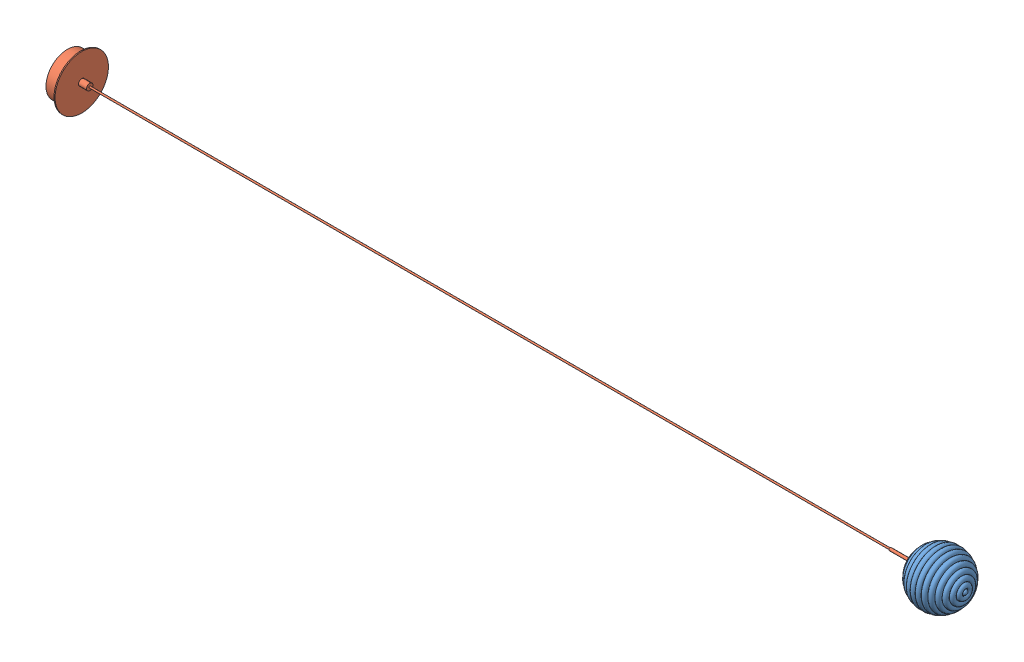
SolidWorks assembly DOUL - COLGANTE - SENCILLO.SLDASM, configuration Predeterminado (file format 11000). Lengths in mm.
Overall size (1686 149.11 138.21).
2 component instances, 2 part files, 14 mates.
Components (placement in the parent):
- CABEZAL_DOUL-1: CABEZAL_DOUL.SLDPRT [Predeterminado] at (1611 -11.1621 0.5279) x (0 0.561419 -0.827532) z (0 0.827532 0.561419) size (99.51 96.11 99.51)
- ESTRUCTURA_COLGANTE_SENCILLO_DOUL-1: ESTRUCTURA_COLGANTE_SENCILLO_DOUL.SLDPRT [Predeterminado] at (0 -11.1621 0.5279) size (1594 130 100)
Mates (geometry in assembly coordinates):
- Concéntrica3: concentric: cylinder of assembly through (0 0 0) axis (0 1 0) radius 7; cylinder of ? through (0 150 0) axis (0 1 0) radius 7
- Coincidente4: coincident: plane of assembly through (0 150 0) normal (0 1 0); plane of ? through (0 150 0) normal (0 -1 0)
- Concéntrica11: concentric: cylinder of assembly through (-450 0 0) axis (0 1 0) radius 7; cylinder of ? through (-450 520 0) axis (0 -1 0) radius 7
- Coincidente12: coincident: plane of assembly through (-450 20 0) normal (0 1 0); plane of ? through (-450 20 0) normal (0 -1 0)
- Concéntrica12: concentric: cylinder of assembly through (80 -15.5 0) axis (0 1 0) radius 7; cylinder of ? through (80 80 0) axis (0 1 0) radius 7
- Coincidente13: coincident: plane of assembly through (80 80 0) normal (0 1 0); plane of ? through (80 80 0) normal (0 -1 0)
- Concéntrica13: concentric: cylinder of ? through (80 80 0) axis (0 1 0) radius 7; cylinder of assembly through (80 -13.3 0) axis (0 1 0) radius 6
- Coincidente14: coincident: plane of ? through (80 80 0) normal (0 -1 0); plane of assembly through (80 80 0) normal (0 1 0)
- Concéntrica14: concentric: cylinder of ? through (60 92 0) axis (0 -1 0) radius 11; cylinder of assembly through (60 82 0) axis (0 -1 0) radius 13
- Coincidente15: coincident: line of ? through (-29.7506 60 82) axis (0 0 -1); plane of assembly through (60 82 0) normal (0 1 0)
- Concéntrica15: concentric: cylinder of ? through (1579 0 0) axis (-1 0 0) radius 11; cylinder of assembly through (17 0 0) axis (-1 0 0) radius 6
- Coincidente16: coincident: plane of ? through (1569 0 0) normal (-1 0 0); plane of assembly through (1569 0 0) normal (1 0 0)
- Concéntrica16: concentric: cylinder of assembly; cylinder of assembly; cylinder of CABEZAL_DOUL-1 through (1579 -11.1621 0.5279) axis (-1 0 0) radius 11; cylinder of ESTRUCTURA_COLGANTE_SENCILLO_DOUL-1 through (1569 -11.1621 0.5279) axis (-1 0 0) radius 13
- Coincidente17: coincident: plane of assembly; plane of assembly; plane of CABEZAL_DOUL-1 through (1569 -11.1621 0.5279) normal (-1 0 0); plane of ESTRUCTURA_COLGANTE_SENCILLO_DOUL-1 through (1569 -11.1621 0.5279) normal (1 0 0)
